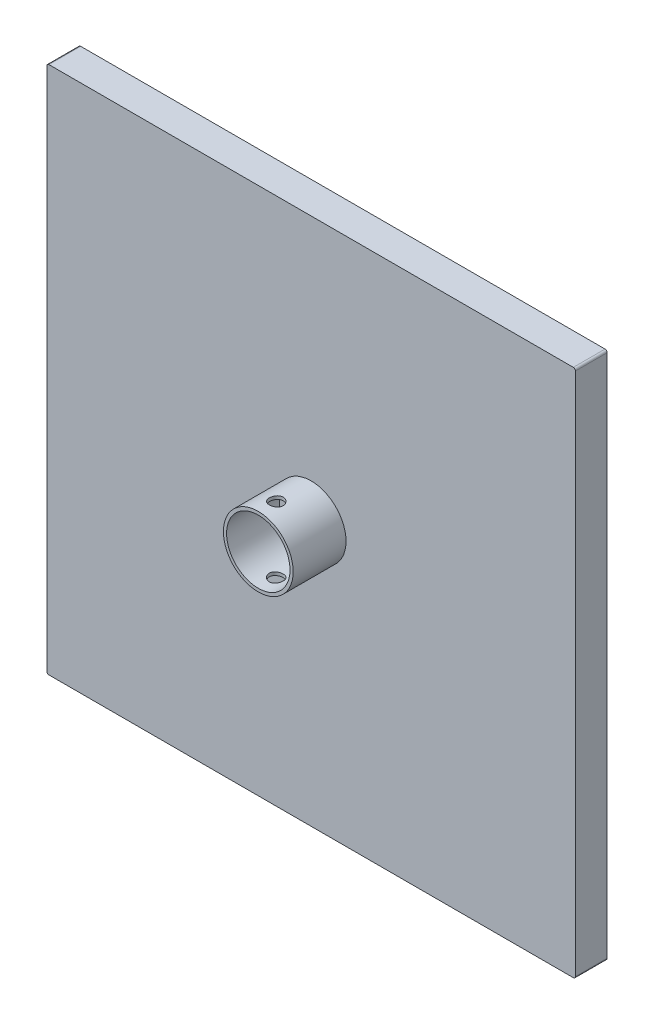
from build123d import *

# Parameters (mm, degrees)
ESQUISSE1_W                  = 500
ESQUISSE1_H                  = 500
BOSS_EXTRU_1_DEPTH           = 30
ESQUISSE2_R                  = 33
ESQUISSE2_R_2                = 30
BOSS_EXTRU_2_DEPTH           = 50
ENL_V_MAT_EXTRU_2_DEPTH      = 50
ENL_V_MAT_EXTRU_2_DEPTH_BACK = 50
ESQUISSE5_R                  = 6.5
CONG_1_R                     = 2


with BuildPart() as part:
    # Esquisse1 → Boss.-Extru.1 (new body)
    with BuildSketch(Plane.XY):
        Rectangle(ESQUISSE1_W, ESQUISSE1_H)
    extrude(amount=BOSS_EXTRU_1_DEPTH)

    # Esquisse2 → Boss.-Extru.2 (add)
    with BuildSketch(Plane.XY.offset(30)):
        Circle(ESQUISSE2_R)
        Circle(ESQUISSE2_R_2, mode=Mode.SUBTRACT)
    extrude(amount=BOSS_EXTRU_2_DEPTH)

    # Esquisse5 → Enl_v. mat.-Extru.2 (cut, two sides: drawn at the far end of the back side and taken through both)
    with BuildSketch(Plane(origin=(0, 0, 0), x_dir=(1, 0, 0), z_dir=(0, 1, 0)).offset(-ENL_V_MAT_EXTRU_2_DEPTH_BACK)):
        with Locations(Location((0, -63, 0), (0, 0, 90))):
            Circle(ESQUISSE5_R)
    extrude(amount=ENL_V_MAT_EXTRU_2_DEPTH + ENL_V_MAT_EXTRU_2_DEPTH_BACK, mode=Mode.SUBTRACT)

    # Cong_1
    cong_1_edges = [part.edges().sort_by_distance(p)[0] for p in [
        (250, -250, 15),
        (-250, -250, 15),
        (-250, 250, 15),
        (250, 250, 15),
    ]]
    fillet(cong_1_edges, radius=CONG_1_R)


solid = part.part
